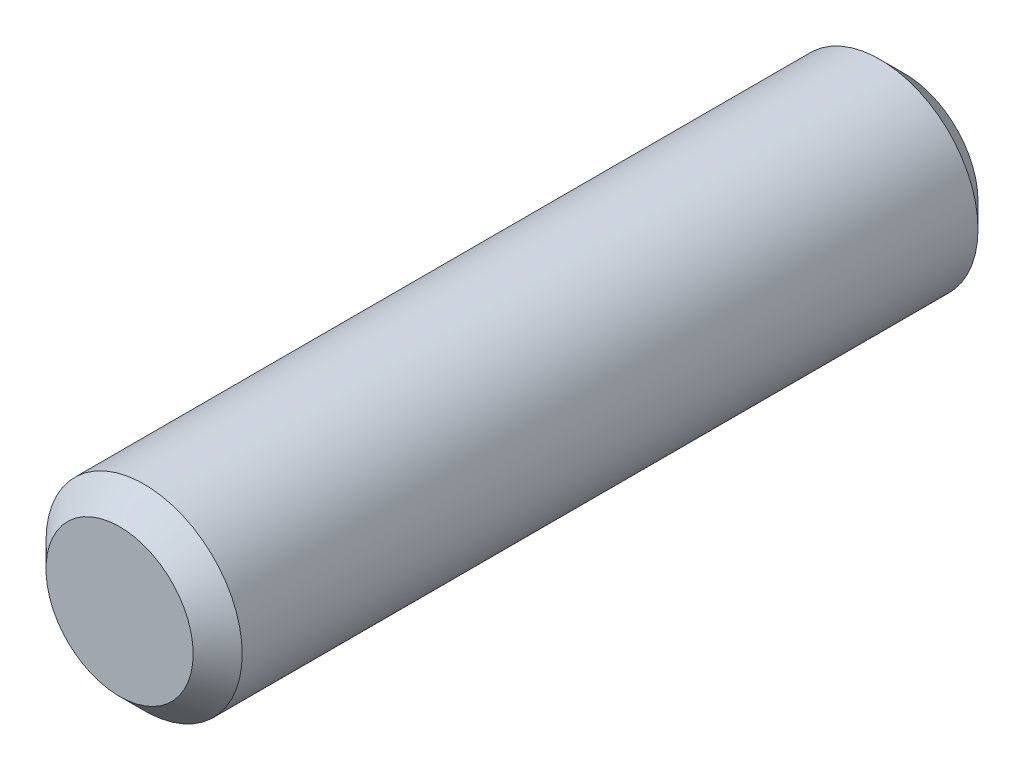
from build123d import *

# Parameters (mm, degrees)
ESQUISSE1_R        = 2
BOSS_EXTRU_1_DEPTH = 16
CHANFREIN1_SIZE    = 0.5


with BuildPart() as part:
    # Esquisse1 → Boss.-Extru.1 (new body)
    with BuildSketch(Plane.XY):
        Circle(ESQUISSE1_R)
    extrude(amount=BOSS_EXTRU_1_DEPTH)

    # Chanfrein1
    chanfrein1_edges = [part.edges().sort_by_distance(p)[0] for p in [
        (-2, 0, 0),
        (-2, 0, 16),
    ]]
    chamfer(chanfrein1_edges, length=CHANFREIN1_SIZE)


solid = part.part
